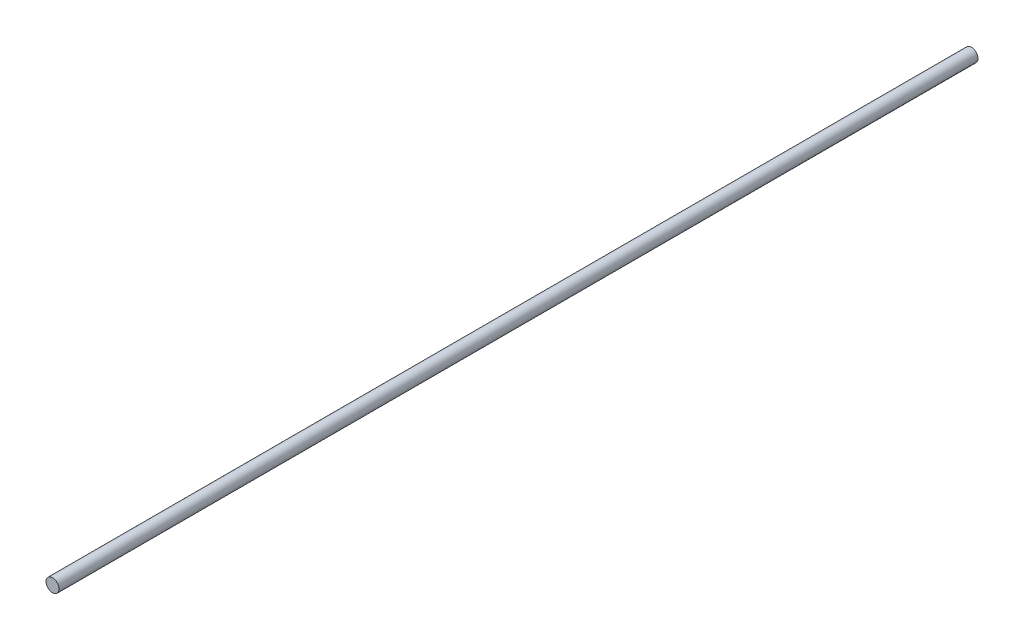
ISO-10303-21;
HEADER;
FILE_DESCRIPTION(('STEP AP214'),'2;1');
FILE_NAME('part.step','',(''),(''),'','','');
FILE_SCHEMA(('AUTOMOTIVE_DESIGN { 1 0 10303 214 1 1 1 1 }'));
ENDSEC;
DATA;
#1=APPLICATION_CONTEXT('core data for automotive mechanical design processes');
#2=APPLICATION_PROTOCOL_DEFINITION('international standard','automotive_design',2000,#1);
#3=PRODUCT_CONTEXT('',#1,'mechanical');
#4=PRODUCT('Part','Part','',(#3));
#5=PRODUCT_RELATED_PRODUCT_CATEGORY('part','',(#4));
#6=PRODUCT_DEFINITION_FORMATION('','',#4);
#7=PRODUCT_DEFINITION_CONTEXT('part definition',#1,'design');
#8=PRODUCT_DEFINITION('design','',#6,#7);
#9=PRODUCT_DEFINITION_SHAPE('','',#8);
#10=(LENGTH_UNIT() NAMED_UNIT(*) SI_UNIT(.MILLI.,.METRE.));
#11=(NAMED_UNIT(*) PLANE_ANGLE_UNIT() SI_UNIT($,.RADIAN.));
#12=(NAMED_UNIT(*) SI_UNIT($,.STERADIAN.) SOLID_ANGLE_UNIT());
#13=UNCERTAINTY_MEASURE_WITH_UNIT(LENGTH_MEASURE(1.E-05),#10,'distance_accuracy_value','');
#14=(GEOMETRIC_REPRESENTATION_CONTEXT(3) GLOBAL_UNCERTAINTY_ASSIGNED_CONTEXT((#13)) GLOBAL_UNIT_ASSIGNED_CONTEXT((#10,
#11,#12)) REPRESENTATION_CONTEXT('',''));
#15=CARTESIAN_POINT('',(0.,0.,0.));
#16=DIRECTION('',(0.,0.,1.));
#17=DIRECTION('',(1.,0.,0.));
#18=AXIS2_PLACEMENT_3D('',#15,#16,#17);
#19=CARTESIAN_POINT('',(0.,0.,140.5));
#20=DIRECTION('',(0.,0.,-1.));
#21=DIRECTION('',(-1.,0.,0.));
#22=AXIS2_PLACEMENT_3D('',#19,#20,#21);
#23=CYLINDRICAL_SURFACE('',#22,1.);
#24=CARTESIAN_POINT('',(0.,0.,140.5));
#25=DIRECTION('',(0.,0.,1.));
#26=DIRECTION('',(1.,0.,0.));
#27=AXIS2_PLACEMENT_3D('',#24,#25,#26);
#28=CIRCLE('',#27,1.);
#29=CARTESIAN_POINT('',(1.,0.,140.5));
#30=VERTEX_POINT('',#29);
#31=EDGE_CURVE('E10',#30,#30,#28,.T.);
#32=ORIENTED_EDGE('',*,*,#31,.F.);
#33=EDGE_LOOP('',(#32));
#34=FACE_BOUND('',#33,.T.);
#35=CARTESIAN_POINT('',(0.,0.,0.));
#36=DIRECTION('',(0.,0.,1.));
#37=DIRECTION('',(1.,0.,0.));
#38=AXIS2_PLACEMENT_3D('',#35,#36,#37);
#39=CIRCLE('',#38,1.);
#40=CARTESIAN_POINT('',(1.,0.,0.));
#41=VERTEX_POINT('',#40);
#42=EDGE_CURVE('E38',#41,#41,#39,.T.);
#43=ORIENTED_EDGE('',*,*,#42,.T.);
#44=EDGE_LOOP('',(#43));
#45=FACE_BOUND('',#44,.T.);
#46=ADVANCED_FACE('F32',(#34,#45),#23,.T.);
#47=CARTESIAN_POINT('',(0.,0.,140.5));
#48=DIRECTION('',(0.,0.,1.));
#49=DIRECTION('',(1.,0.,0.));
#50=AXIS2_PLACEMENT_3D('',#47,#48,#49);
#51=PLANE('',#50);
#52=ORIENTED_EDGE('',*,*,#31,.T.);
#53=EDGE_LOOP('',(#52));
#54=FACE_BOUND('',#53,.T.);
#55=ADVANCED_FACE('F47',(#54),#51,.T.);
#56=CARTESIAN_POINT('',(0.,0.,0.));
#57=DIRECTION('',(0.,0.,1.));
#58=DIRECTION('',(1.,0.,0.));
#59=AXIS2_PLACEMENT_3D('',#56,#57,#58);
#60=PLANE('',#59);
#61=ORIENTED_EDGE('',*,*,#42,.F.);
#62=EDGE_LOOP('',(#61));
#63=FACE_BOUND('',#62,.T.);
#64=ADVANCED_FACE('F45',(#63),#60,.F.);
#65=CLOSED_SHELL('',(#46,#55,#64));
#66=MANIFOLD_SOLID_BREP('B2',#65);
#67=ADVANCED_BREP_SHAPE_REPRESENTATION('',(#18,#66),#14);
#68=SHAPE_DEFINITION_REPRESENTATION(#9,#67);
ENDSEC;
END-ISO-10303-21;
